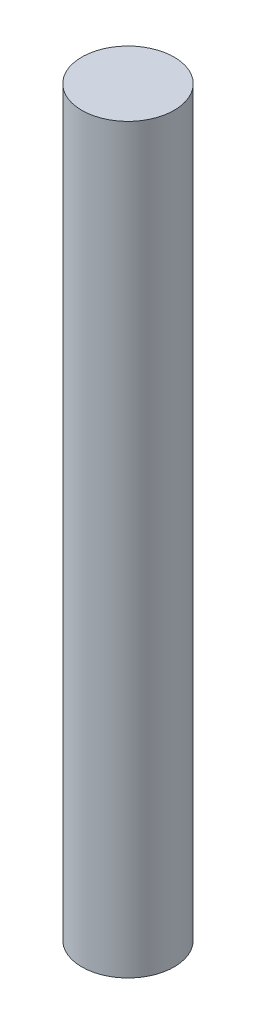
ISO-10303-21;
HEADER;
FILE_DESCRIPTION(('STEP AP214'),'2;1');
FILE_NAME('part.step','',(''),(''),'','','');
FILE_SCHEMA(('AUTOMOTIVE_DESIGN { 1 0 10303 214 1 1 1 1 }'));
ENDSEC;
DATA;
#1=APPLICATION_CONTEXT('core data for automotive mechanical design processes');
#2=APPLICATION_PROTOCOL_DEFINITION('international standard','automotive_design',2000,#1);
#3=PRODUCT_CONTEXT('',#1,'mechanical');
#4=PRODUCT('Part','Part','',(#3));
#5=PRODUCT_RELATED_PRODUCT_CATEGORY('part','',(#4));
#6=PRODUCT_DEFINITION_FORMATION('','',#4);
#7=PRODUCT_DEFINITION_CONTEXT('part definition',#1,'design');
#8=PRODUCT_DEFINITION('design','',#6,#7);
#9=PRODUCT_DEFINITION_SHAPE('','',#8);
#10=(LENGTH_UNIT() NAMED_UNIT(*) SI_UNIT(.MILLI.,.METRE.));
#11=(NAMED_UNIT(*) PLANE_ANGLE_UNIT() SI_UNIT($,.RADIAN.));
#12=(NAMED_UNIT(*) SI_UNIT($,.STERADIAN.) SOLID_ANGLE_UNIT());
#13=UNCERTAINTY_MEASURE_WITH_UNIT(LENGTH_MEASURE(1.E-05),#10,'distance_accuracy_value','');
#14=(GEOMETRIC_REPRESENTATION_CONTEXT(3) GLOBAL_UNCERTAINTY_ASSIGNED_CONTEXT((#13)) GLOBAL_UNIT_ASSIGNED_CONTEXT((#10,
#11,#12)) REPRESENTATION_CONTEXT('',''));
#15=CARTESIAN_POINT('',(0.,0.,0.));
#16=DIRECTION('',(0.,0.,1.));
#17=DIRECTION('',(1.,0.,0.));
#18=AXIS2_PLACEMENT_3D('',#15,#16,#17);
#19=CARTESIAN_POINT('',(0.,450.,0.));
#20=DIRECTION('',(0.,-1.,0.));
#21=DIRECTION('',(0.,0.,-1.));
#22=AXIS2_PLACEMENT_3D('',#19,#20,#21);
#23=CYLINDRICAL_SURFACE('',#22,28.);
#24=CARTESIAN_POINT('',(0.,450.,0.));
#25=DIRECTION('',(0.,1.,0.));
#26=DIRECTION('',(0.,0.,1.));
#27=AXIS2_PLACEMENT_3D('',#24,#25,#26);
#28=CIRCLE('',#27,28.);
#29=CARTESIAN_POINT('',(0.,450.,28.));
#30=VERTEX_POINT('',#29);
#31=EDGE_CURVE('E10',#30,#30,#28,.T.);
#32=ORIENTED_EDGE('',*,*,#31,.F.);
#33=EDGE_LOOP('',(#32));
#34=FACE_BOUND('',#33,.T.);
#35=CARTESIAN_POINT('',(0.,0.,0.));
#36=DIRECTION('',(0.,1.,0.));
#37=DIRECTION('',(0.,0.,1.));
#38=AXIS2_PLACEMENT_3D('',#35,#36,#37);
#39=CIRCLE('',#38,28.);
#40=CARTESIAN_POINT('',(0.,0.,28.));
#41=VERTEX_POINT('',#40);
#42=EDGE_CURVE('E40',#41,#41,#39,.T.);
#43=ORIENTED_EDGE('',*,*,#42,.T.);
#44=EDGE_LOOP('',(#43));
#45=FACE_BOUND('',#44,.T.);
#46=ADVANCED_FACE('F37',(#34,#45),#23,.T.);
#47=CARTESIAN_POINT('',(0.,450.,0.));
#48=DIRECTION('',(0.,1.,0.));
#49=DIRECTION('',(0.,0.,1.));
#50=AXIS2_PLACEMENT_3D('',#47,#48,#49);
#51=PLANE('',#50);
#52=ORIENTED_EDGE('',*,*,#31,.T.);
#53=EDGE_LOOP('',(#52));
#54=FACE_BOUND('',#53,.T.);
#55=ADVANCED_FACE('F64',(#54),#51,.T.);
#56=CARTESIAN_POINT('',(0.,0.,0.));
#57=DIRECTION('',(0.,1.,0.));
#58=DIRECTION('',(0.,0.,1.));
#59=AXIS2_PLACEMENT_3D('',#56,#57,#58);
#60=PLANE('',#59);
#61=CARTESIAN_POINT('',(0.,0.,0.));
#62=DIRECTION('',(0.,-1.,0.));
#63=DIRECTION('',(0.,0.,-1.));
#64=AXIS2_PLACEMENT_3D('',#61,#62,#63);
#65=CIRCLE('',#64,25.);
#66=CARTESIAN_POINT('',(0.,0.,-25.));
#67=VERTEX_POINT('',#66);
#68=EDGE_CURVE('E54',#67,#67,#65,.T.);
#69=ORIENTED_EDGE('',*,*,#68,.F.);
#70=EDGE_LOOP('',(#69));
#71=FACE_BOUND('',#70,.T.);
#72=ORIENTED_EDGE('',*,*,#42,.F.);
#73=EDGE_LOOP('',(#72));
#74=FACE_BOUND('',#73,.T.);
#75=ADVANCED_FACE('F61',(#71,#74),#60,.F.);
#76=CARTESIAN_POINT('',(0.,0.,0.));
#77=DIRECTION('',(0.,-1.,0.));
#78=DIRECTION('',(0.,0.,-1.));
#79=AXIS2_PLACEMENT_3D('',#76,#77,#78);
#80=CONICAL_SURFACE('',#79,25.,0.733038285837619);
#81=CARTESIAN_POINT('',(0.,5.,0.));
#82=DIRECTION('',(0.,-1.,0.));
#83=DIRECTION('',(0.,0.,-1.));
#84=AXIS2_PLACEMENT_3D('',#81,#82,#83);
#85=CIRCLE('',#84,20.4979797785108);
#86=CARTESIAN_POINT('',(0.,5.,-20.4979797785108));
#87=VERTEX_POINT('',#86);
#88=EDGE_CURVE('E49',#87,#87,#85,.T.);
#89=ORIENTED_EDGE('',*,*,#88,.F.);
#90=EDGE_LOOP('',(#89));
#91=FACE_BOUND('',#90,.T.);
#92=ORIENTED_EDGE('',*,*,#68,.T.);
#93=EDGE_LOOP('',(#92));
#94=FACE_BOUND('',#93,.T.);
#95=ADVANCED_FACE('F59',(#91,#94),#80,.F.);
#96=CARTESIAN_POINT('',(0.,5.,0.));
#97=DIRECTION('',(0.,-1.,0.));
#98=DIRECTION('',(0.,0.,-1.));
#99=AXIS2_PLACEMENT_3D('',#96,#97,#98);
#100=PLANE('',#99);
#101=ORIENTED_EDGE('',*,*,#88,.T.);
#102=EDGE_LOOP('',(#101));
#103=FACE_BOUND('',#102,.T.);
#104=ADVANCED_FACE('F78',(#103),#100,.T.);
#105=CLOSED_SHELL('',(#46,#55,#75,#95,#104));
#106=MANIFOLD_SOLID_BREP('B2',#105);
#107=ADVANCED_BREP_SHAPE_REPRESENTATION('',(#18,#106),#14);
#108=SHAPE_DEFINITION_REPRESENTATION(#9,#107);
ENDSEC;
END-ISO-10303-21;
